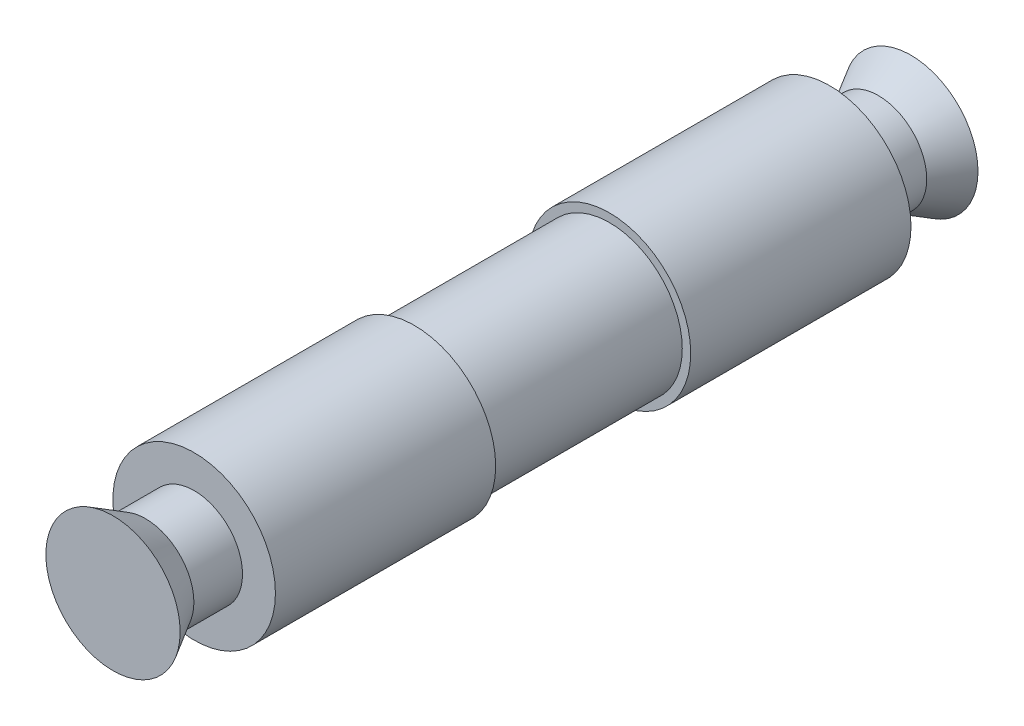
ISO-10303-21;
HEADER;
FILE_DESCRIPTION(('STEP AP214'),'2;1');
FILE_NAME('part.step','',(''),(''),'','','');
FILE_SCHEMA(('AUTOMOTIVE_DESIGN { 1 0 10303 214 1 1 1 1 }'));
ENDSEC;
DATA;
#1=APPLICATION_CONTEXT('core data for automotive mechanical design processes');
#2=APPLICATION_PROTOCOL_DEFINITION('international standard','automotive_design',2000,#1);
#3=PRODUCT_CONTEXT('',#1,'mechanical');
#4=PRODUCT('Part','Part','',(#3));
#5=PRODUCT_RELATED_PRODUCT_CATEGORY('part','',(#4));
#6=PRODUCT_DEFINITION_FORMATION('','',#4);
#7=PRODUCT_DEFINITION_CONTEXT('part definition',#1,'design');
#8=PRODUCT_DEFINITION('design','',#6,#7);
#9=PRODUCT_DEFINITION_SHAPE('','',#8);
#10=(LENGTH_UNIT() NAMED_UNIT(*) SI_UNIT(.MILLI.,.METRE.));
#11=(NAMED_UNIT(*) PLANE_ANGLE_UNIT() SI_UNIT($,.RADIAN.));
#12=(NAMED_UNIT(*) SI_UNIT($,.STERADIAN.) SOLID_ANGLE_UNIT());
#13=UNCERTAINTY_MEASURE_WITH_UNIT(LENGTH_MEASURE(1.E-05),#10,'distance_accuracy_value','');
#14=(GEOMETRIC_REPRESENTATION_CONTEXT(3) GLOBAL_UNCERTAINTY_ASSIGNED_CONTEXT((#13)) GLOBAL_UNIT_ASSIGNED_CONTEXT((#10,
#11,#12)) REPRESENTATION_CONTEXT('',''));
#15=CARTESIAN_POINT('',(0.,0.,0.));
#16=DIRECTION('',(0.,0.,1.));
#17=DIRECTION('',(1.,0.,0.));
#18=AXIS2_PLACEMENT_3D('',#15,#16,#17);
#19=CARTESIAN_POINT('',(0.,3.27874355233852,0.));
#20=DIRECTION('',(0.,0.,-1.));
#21=DIRECTION('',(-1.,0.,0.));
#22=AXIS2_PLACEMENT_3D('',#19,#20,#21);
#23=PLANE('',#22);
#24=CARTESIAN_POINT('',(0.,0.,0.));
#25=DIRECTION('',(0.,0.,1.));
#26=DIRECTION('',(1.,0.,0.));
#27=AXIS2_PLACEMENT_3D('',#24,#25,#26);
#28=CIRCLE('',#27,3.27874355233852);
#29=CARTESIAN_POINT('',(3.27874355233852,0.,0.));
#30=VERTEX_POINT('',#29);
#31=EDGE_CURVE('E73',#30,#30,#28,.T.);
#32=ORIENTED_EDGE('',*,*,#31,.T.);
#33=EDGE_LOOP('',(#32));
#34=FACE_BOUND('',#33,.T.);
#35=ADVANCED_FACE('F33',(#34),#23,.F.);
#36=CARTESIAN_POINT('',(0.,0.,-38.9636));
#37=DIRECTION('',(0.,0.,1.));
#38=DIRECTION('',(1.,0.,0.));
#39=AXIS2_PLACEMENT_3D('',#36,#37,#38);
#40=PLANE('',#39);
#41=CARTESIAN_POINT('',(0.,0.,-38.9636));
#42=DIRECTION('',(0.,0.,1.));
#43=DIRECTION('',(1.,0.,0.));
#44=AXIS2_PLACEMENT_3D('',#41,#42,#43);
#45=CIRCLE('',#44,3.27874355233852);
#46=CARTESIAN_POINT('',(3.27874355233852,0.,-38.9636));
#47=VERTEX_POINT('',#46);
#48=EDGE_CURVE('E10',#47,#47,#45,.T.);
#49=ORIENTED_EDGE('',*,*,#48,.F.);
#50=EDGE_LOOP('',(#49));
#51=FACE_BOUND('',#50,.T.);
#52=ADVANCED_FACE('F139',(#51),#40,.F.);
#53=CARTESIAN_POINT('',(0.,0.,-38.9636));
#54=DIRECTION('',(0.,0.,-1.));
#55=DIRECTION('',(-1.,0.,0.));
#56=AXIS2_PLACEMENT_3D('',#53,#54,#55);
#57=CONICAL_SURFACE('',#56,3.27874355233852,0.523598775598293);
#58=CARTESIAN_POINT('',(0.,0.,-37.3761));
#59=DIRECTION('',(0.,0.,1.));
#60=DIRECTION('',(1.,0.,0.));
#61=AXIS2_PLACEMENT_3D('',#58,#59,#60);
#62=CIRCLE('',#61,2.3622);
#63=CARTESIAN_POINT('',(2.3622,0.,-37.3761));
#64=VERTEX_POINT('',#63);
#65=EDGE_CURVE('E39',#64,#64,#62,.T.);
#66=ORIENTED_EDGE('',*,*,#65,.F.);
#67=EDGE_LOOP('',(#66));
#68=FACE_BOUND('',#67,.T.);
#69=ORIENTED_EDGE('',*,*,#48,.T.);
#70=EDGE_LOOP('',(#69));
#71=FACE_BOUND('',#70,.T.);
#72=ADVANCED_FACE('F134',(#68,#71),#57,.T.);
#73=CARTESIAN_POINT('',(0.,0.,0.));
#74=DIRECTION('',(0.,0.,1.));
#75=DIRECTION('',(1.,0.,0.));
#76=AXIS2_PLACEMENT_3D('',#73,#74,#75);
#77=CYLINDRICAL_SURFACE('',#76,2.3622);
#78=CARTESIAN_POINT('',(0.,0.,-35.0012));
#79=DIRECTION('',(0.,0.,1.));
#80=DIRECTION('',(1.,0.,0.));
#81=AXIS2_PLACEMENT_3D('',#78,#79,#80);
#82=CIRCLE('',#81,2.3622);
#83=CARTESIAN_POINT('',(2.3622,0.,-35.0012));
#84=VERTEX_POINT('',#83);
#85=EDGE_CURVE('E43',#84,#84,#82,.T.);
#86=ORIENTED_EDGE('',*,*,#85,.F.);
#87=EDGE_LOOP('',(#86));
#88=FACE_BOUND('',#87,.T.);
#89=ORIENTED_EDGE('',*,*,#65,.T.);
#90=EDGE_LOOP('',(#89));
#91=FACE_BOUND('',#90,.T.);
#92=ADVANCED_FACE('F129',(#88,#91),#77,.T.);
#93=CARTESIAN_POINT('',(0.,2.3622,-35.0012));
#94=DIRECTION('',(0.,0.,1.));
#95=DIRECTION('',(1.,0.,0.));
#96=AXIS2_PLACEMENT_3D('',#93,#94,#95);
#97=PLANE('',#96);
#98=CARTESIAN_POINT('',(0.,0.,-35.0012));
#99=DIRECTION('',(0.,0.,1.));
#100=DIRECTION('',(1.,0.,0.));
#101=AXIS2_PLACEMENT_3D('',#98,#99,#100);
#102=CIRCLE('',#101,3.96875);
#103=CARTESIAN_POINT('',(3.96875,0.,-35.0012));
#104=VERTEX_POINT('',#103);
#105=EDGE_CURVE('E47',#104,#104,#102,.T.);
#106=ORIENTED_EDGE('',*,*,#105,.F.);
#107=EDGE_LOOP('',(#106));
#108=FACE_BOUND('',#107,.T.);
#109=ORIENTED_EDGE('',*,*,#85,.T.);
#110=EDGE_LOOP('',(#109));
#111=FACE_BOUND('',#110,.T.);
#112=ADVANCED_FACE('F123',(#108,#111),#97,.F.);
#113=CARTESIAN_POINT('',(0.,0.,0.));
#114=DIRECTION('',(0.,0.,1.));
#115=DIRECTION('',(1.,0.,0.));
#116=AXIS2_PLACEMENT_3D('',#113,#114,#115);
#117=CYLINDRICAL_SURFACE('',#116,3.96875);
#118=CARTESIAN_POINT('',(0.,0.,-24.2443));
#119=DIRECTION('',(0.,0.,1.));
#120=DIRECTION('',(1.,0.,0.));
#121=AXIS2_PLACEMENT_3D('',#118,#119,#120);
#122=CIRCLE('',#121,3.96875);
#123=CARTESIAN_POINT('',(3.96875,0.,-24.2443));
#124=VERTEX_POINT('',#123);
#125=EDGE_CURVE('E52',#124,#124,#122,.T.);
#126=ORIENTED_EDGE('',*,*,#125,.F.);
#127=EDGE_LOOP('',(#126));
#128=FACE_BOUND('',#127,.T.);
#129=ORIENTED_EDGE('',*,*,#105,.T.);
#130=EDGE_LOOP('',(#129));
#131=FACE_BOUND('',#130,.T.);
#132=ADVANCED_FACE('F117',(#128,#131),#117,.T.);
#133=CARTESIAN_POINT('',(0.,3.96875,-24.2443));
#134=DIRECTION('',(0.,0.,-1.));
#135=DIRECTION('',(-1.,0.,0.));
#136=AXIS2_PLACEMENT_3D('',#133,#134,#135);
#137=PLANE('',#136);
#138=CARTESIAN_POINT('',(0.,0.,-24.2443));
#139=DIRECTION('',(0.,0.,1.));
#140=DIRECTION('',(1.,0.,0.));
#141=AXIS2_PLACEMENT_3D('',#138,#139,#140);
#142=CIRCLE('',#141,3.556);
#143=CARTESIAN_POINT('',(3.556,0.,-24.2443));
#144=VERTEX_POINT('',#143);
#145=EDGE_CURVE('E55',#144,#144,#142,.T.);
#146=ORIENTED_EDGE('',*,*,#145,.F.);
#147=EDGE_LOOP('',(#146));
#148=FACE_BOUND('',#147,.T.);
#149=ORIENTED_EDGE('',*,*,#125,.T.);
#150=EDGE_LOOP('',(#149));
#151=FACE_BOUND('',#150,.T.);
#152=ADVANCED_FACE('F111',(#148,#151),#137,.F.);
#153=CARTESIAN_POINT('',(0.,0.,0.));
#154=DIRECTION('',(0.,0.,1.));
#155=DIRECTION('',(1.,0.,0.));
#156=AXIS2_PLACEMENT_3D('',#153,#154,#155);
#157=CYLINDRICAL_SURFACE('',#156,3.556);
#158=CARTESIAN_POINT('',(0.,0.,-14.7193));
#159=DIRECTION('',(0.,0.,1.));
#160=DIRECTION('',(1.,0.,0.));
#161=AXIS2_PLACEMENT_3D('',#158,#159,#160);
#162=CIRCLE('',#161,3.556);
#163=CARTESIAN_POINT('',(3.556,0.,-14.7193));
#164=VERTEX_POINT('',#163);
#165=EDGE_CURVE('E58',#164,#164,#162,.T.);
#166=ORIENTED_EDGE('',*,*,#165,.F.);
#167=EDGE_LOOP('',(#166));
#168=FACE_BOUND('',#167,.T.);
#169=ORIENTED_EDGE('',*,*,#145,.T.);
#170=EDGE_LOOP('',(#169));
#171=FACE_BOUND('',#170,.T.);
#172=ADVANCED_FACE('F105',(#168,#171),#157,.T.);
#173=CARTESIAN_POINT('',(0.,3.556,-14.7193));
#174=DIRECTION('',(0.,0.,1.));
#175=DIRECTION('',(1.,0.,0.));
#176=AXIS2_PLACEMENT_3D('',#173,#174,#175);
#177=PLANE('',#176);
#178=CARTESIAN_POINT('',(0.,0.,-14.7193));
#179=DIRECTION('',(0.,0.,1.));
#180=DIRECTION('',(1.,0.,0.));
#181=AXIS2_PLACEMENT_3D('',#178,#179,#180);
#182=CIRCLE('',#181,3.96875);
#183=CARTESIAN_POINT('',(3.96875,0.,-14.7193));
#184=VERTEX_POINT('',#183);
#185=EDGE_CURVE('E61',#184,#184,#182,.T.);
#186=ORIENTED_EDGE('',*,*,#185,.F.);
#187=EDGE_LOOP('',(#186));
#188=FACE_BOUND('',#187,.T.);
#189=ORIENTED_EDGE('',*,*,#165,.T.);
#190=EDGE_LOOP('',(#189));
#191=FACE_BOUND('',#190,.T.);
#192=ADVANCED_FACE('F99',(#188,#191),#177,.F.);
#193=CARTESIAN_POINT('',(0.,0.,0.));
#194=DIRECTION('',(0.,0.,1.));
#195=DIRECTION('',(1.,0.,0.));
#196=AXIS2_PLACEMENT_3D('',#193,#194,#195);
#197=CYLINDRICAL_SURFACE('',#196,3.96875);
#198=CARTESIAN_POINT('',(0.,0.,-3.9624));
#199=DIRECTION('',(0.,0.,1.));
#200=DIRECTION('',(1.,0.,0.));
#201=AXIS2_PLACEMENT_3D('',#198,#199,#200);
#202=CIRCLE('',#201,3.96875);
#203=CARTESIAN_POINT('',(3.96875,0.,-3.9624));
#204=VERTEX_POINT('',#203);
#205=EDGE_CURVE('E64',#204,#204,#202,.T.);
#206=ORIENTED_EDGE('',*,*,#205,.F.);
#207=EDGE_LOOP('',(#206));
#208=FACE_BOUND('',#207,.T.);
#209=ORIENTED_EDGE('',*,*,#185,.T.);
#210=EDGE_LOOP('',(#209));
#211=FACE_BOUND('',#210,.T.);
#212=ADVANCED_FACE('F93',(#208,#211),#197,.T.);
#213=CARTESIAN_POINT('',(0.,3.96875,-3.9624));
#214=DIRECTION('',(0.,0.,-1.));
#215=DIRECTION('',(-1.,0.,0.));
#216=AXIS2_PLACEMENT_3D('',#213,#214,#215);
#217=PLANE('',#216);
#218=CARTESIAN_POINT('',(0.,0.,-3.9624));
#219=DIRECTION('',(0.,0.,1.));
#220=DIRECTION('',(1.,0.,0.));
#221=AXIS2_PLACEMENT_3D('',#218,#219,#220);
#222=CIRCLE('',#221,2.3622);
#223=CARTESIAN_POINT('',(2.3622,0.,-3.9624));
#224=VERTEX_POINT('',#223);
#225=EDGE_CURVE('E67',#224,#224,#222,.T.);
#226=ORIENTED_EDGE('',*,*,#225,.F.);
#227=EDGE_LOOP('',(#226));
#228=FACE_BOUND('',#227,.T.);
#229=ORIENTED_EDGE('',*,*,#205,.T.);
#230=EDGE_LOOP('',(#229));
#231=FACE_BOUND('',#230,.T.);
#232=ADVANCED_FACE('F87',(#228,#231),#217,.F.);
#233=CARTESIAN_POINT('',(0.,0.,0.));
#234=DIRECTION('',(0.,0.,1.));
#235=DIRECTION('',(1.,0.,0.));
#236=AXIS2_PLACEMENT_3D('',#233,#234,#235);
#237=CYLINDRICAL_SURFACE('',#236,2.3622);
#238=CARTESIAN_POINT('',(0.,0.,-1.5875));
#239=DIRECTION('',(0.,0.,1.));
#240=DIRECTION('',(1.,0.,0.));
#241=AXIS2_PLACEMENT_3D('',#238,#239,#240);
#242=CIRCLE('',#241,2.3622);
#243=CARTESIAN_POINT('',(2.3622,0.,-1.5875));
#244=VERTEX_POINT('',#243);
#245=EDGE_CURVE('E70',#244,#244,#242,.T.);
#246=ORIENTED_EDGE('',*,*,#245,.F.);
#247=EDGE_LOOP('',(#246));
#248=FACE_BOUND('',#247,.T.);
#249=ORIENTED_EDGE('',*,*,#225,.T.);
#250=EDGE_LOOP('',(#249));
#251=FACE_BOUND('',#250,.T.);
#252=ADVANCED_FACE('F81',(#248,#251),#237,.T.);
#253=CARTESIAN_POINT('',(0.,0.,-1.5875));
#254=DIRECTION('',(0.,0.,1.));
#255=DIRECTION('',(1.,0.,0.));
#256=AXIS2_PLACEMENT_3D('',#253,#254,#255);
#257=CONICAL_SURFACE('',#256,2.3622,0.523598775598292);
#258=ORIENTED_EDGE('',*,*,#31,.F.);
#259=EDGE_LOOP('',(#258));
#260=FACE_BOUND('',#259,.T.);
#261=ORIENTED_EDGE('',*,*,#245,.T.);
#262=EDGE_LOOP('',(#261));
#263=FACE_BOUND('',#262,.T.);
#264=ADVANCED_FACE('F78',(#260,#263),#257,.T.);
#265=CLOSED_SHELL('',(#35,#52,#72,#92,#112,#132,#152,#172,#192,#212,#232,#252,#264));
#266=MANIFOLD_SOLID_BREP('B2',#265);
#267=ADVANCED_BREP_SHAPE_REPRESENTATION('',(#18,#266),#14);
#268=SHAPE_DEFINITION_REPRESENTATION(#9,#267);
ENDSEC;
END-ISO-10303-21;
